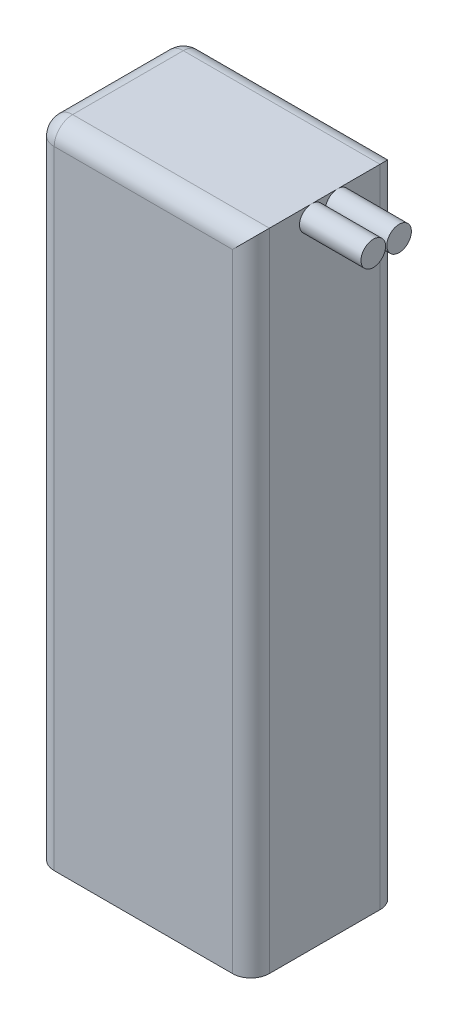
from build123d import *

# Parameters (mm, degrees)
SKETCH2_W           = 35
SKETCH2_H           = 24
BOSS_EXTRUDE1_DEPTH = 105
SKETCH5_R           = 2
BOSS_EXTRUDE2_DEPTH = 10
FILLET1_R           = 3


with BuildPart() as part:
    # Sketch2 → Boss-Extrude1 (new body)
    with BuildSketch(Plane(origin=(0, 0, 0), x_dir=(1, 0, 0), z_dir=(0, 1, 0))):
        with Locations((17.5, 12)):
            Rectangle(SKETCH2_W, SKETCH2_H)
    extrude(amount=BOSS_EXTRUDE1_DEPTH)

    # Sketch5 → Boss-Extrude2 (add)
    with BuildSketch(Plane(origin=(35, 0, 0), x_dir=(0, 0, -1), z_dir=(1, 0, 0))):
        with Locations(Location((9.9, 103, 0), (0, 0, 90))):
            Circle(SKETCH5_R)
        with Locations(Location((14.1, 103, 0), (0, 0, 90))):
            Circle(SKETCH5_R)
    extrude(amount=BOSS_EXTRUDE2_DEPTH)

    # Fillet1
    fillet1_edges = [part.edges().sort_by_distance(p)[0] for p in [
        (17.5, 105, -24),
        (0, 105, -12),
        (0, 52.5, -24),
        (35, 52.5, -24),
        (35, 52.5, 0),
        (0, 52.5, 0),
        (17.5, 105, 0),
    ]]
    fillet(fillet1_edges, radius=FILLET1_R)


solid = part.part
